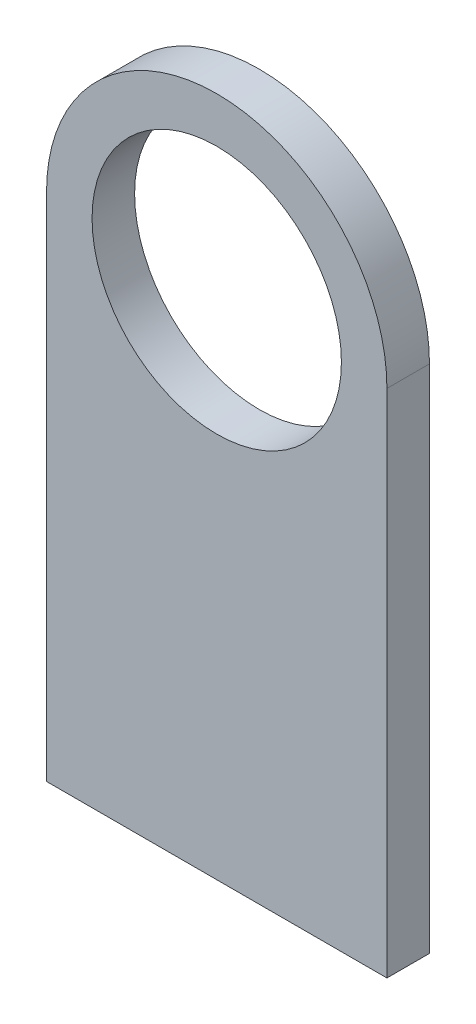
from build123d import *

# Parameters (mm, degrees)
SKETCH1_R      = 27.90825
EXTRUDE1_DEPTH = 9.525


with BuildPart() as part:
    # Sketch1 → Extrude1 (new body)
    with BuildSketch(Plane.XY):
        with BuildLine():
            Line((-36.909942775, -55.751001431), (39.290057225, -55.751001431))
            Line((39.290057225, -55.751001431), (39.290057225, 58.548998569))
            ThreePointArc((39.290057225, 58.548998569), (1.190057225, 96.648998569), (-36.909942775, 58.548998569))
            Line((-36.909942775, 58.548998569), (-36.909942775, -55.751001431))
        make_face()
        with Locations(Location((1.190057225, 58.548998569, 0), (0, 0, 180))):
            Circle(SKETCH1_R, mode=Mode.SUBTRACT)
    extrude(amount=EXTRUDE1_DEPTH)


solid = part.part
